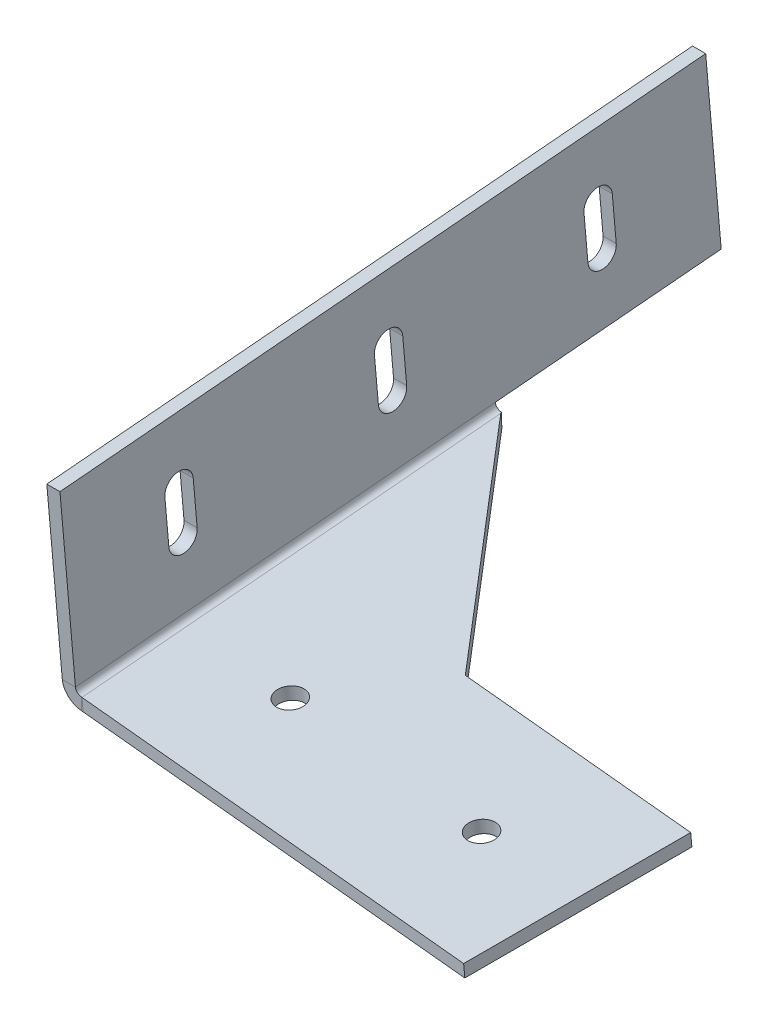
ISO-10303-21;
HEADER;
FILE_DESCRIPTION(('STEP AP214'),'2;1');
FILE_NAME('part.step','',(''),(''),'','','');
FILE_SCHEMA(('AUTOMOTIVE_DESIGN { 1 0 10303 214 1 1 1 1 }'));
ENDSEC;
DATA;
#1=APPLICATION_CONTEXT('core data for automotive mechanical design processes');
#2=APPLICATION_PROTOCOL_DEFINITION('international standard','automotive_design',2000,#1);
#3=PRODUCT_CONTEXT('',#1,'mechanical');
#4=PRODUCT('Part','Part','',(#3));
#5=PRODUCT_RELATED_PRODUCT_CATEGORY('part','',(#4));
#6=PRODUCT_DEFINITION_FORMATION('','',#4);
#7=PRODUCT_DEFINITION_CONTEXT('part definition',#1,'design');
#8=PRODUCT_DEFINITION('design','',#6,#7);
#9=PRODUCT_DEFINITION_SHAPE('','',#8);
#10=(LENGTH_UNIT() NAMED_UNIT(*) SI_UNIT(.MILLI.,.METRE.));
#11=(NAMED_UNIT(*) PLANE_ANGLE_UNIT() SI_UNIT($,.RADIAN.));
#12=(NAMED_UNIT(*) SI_UNIT($,.STERADIAN.) SOLID_ANGLE_UNIT());
#13=UNCERTAINTY_MEASURE_WITH_UNIT(LENGTH_MEASURE(1.E-05),#10,'distance_accuracy_value','');
#14=(GEOMETRIC_REPRESENTATION_CONTEXT(3) GLOBAL_UNCERTAINTY_ASSIGNED_CONTEXT((#13)) GLOBAL_UNIT_ASSIGNED_CONTEXT((#10,
#11,#12)) REPRESENTATION_CONTEXT('',''));
#15=CARTESIAN_POINT('',(0.,0.,0.));
#16=DIRECTION('',(0.,0.,1.));
#17=DIRECTION('',(1.,0.,0.));
#18=AXIS2_PLACEMENT_3D('',#15,#16,#17);
#19=CARTESIAN_POINT('',(27.028955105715,27.8532284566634,2.43684173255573));
#20=DIRECTION('',(0.,-0.996194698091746,-0.0871557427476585));
#21=DIRECTION('',(-0.0871557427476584,-0.0868240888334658,0.992403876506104));
#22=AXIS2_PLACEMENT_3D('',#19,#20,#21);
#23=PLANE('',#22);
#24=CARTESIAN_POINT('',(14.3772824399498,27.9496992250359,1.33417580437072));
#25=DIRECTION('',(0.,0.996194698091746,0.0871557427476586));
#26=DIRECTION('',(0.,-0.0871557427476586,0.996194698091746));
#27=AXIS2_PLACEMENT_3D('',#24,#25,#26);
#28=CIRCLE('',#27,1.651);
#29=CARTESIAN_POINT('',(14.3772824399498,27.8058050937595,2.97889325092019));
#30=VERTEX_POINT('',#29);
#31=EDGE_CURVE('E368',#30,#30,#28,.T.);
#32=ORIENTED_EDGE('',*,*,#31,.F.);
#33=EDGE_LOOP('',(#32));
#34=FACE_BOUND('',#33,.T.);
#35=CARTESIAN_POINT('',(39.6806277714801,27.756757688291,3.53950766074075));
#36=DIRECTION('',(0.,0.996194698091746,0.0871557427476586));
#37=DIRECTION('',(0.,-0.0871557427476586,0.996194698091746));
#38=AXIS2_PLACEMENT_3D('',#35,#36,#37);
#39=CIRCLE('',#38,1.651);
#40=CARTESIAN_POINT('',(39.6806277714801,27.6128635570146,5.18422510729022));
#41=VERTEX_POINT('',#40);
#42=EDGE_CURVE('E372',#41,#41,#39,.T.);
#43=ORIENTED_EDGE('',*,*,#42,.F.);
#44=EDGE_LOOP('',(#43));
#45=FACE_BOUND('',#44,.T.);
#46=DIRECTION('',(-0.642787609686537,0.0667651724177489,-0.763129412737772));
#47=VECTOR('',#46,1.);
#48=CARTESIAN_POINT('',(23.6204584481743,28.9903247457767,-10.5602283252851));
#49=LINE('',#48,#47);
#50=CARTESIAN_POINT('',(23.6204584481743,28.9903247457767,-10.5602283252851));
#51=VERTEX_POINT('',#50);
#52=CARTESIAN_POINT('',(0.736600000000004,31.3672292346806,-37.7283709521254));
#53=VERTEX_POINT('',#52);
#54=EDGE_CURVE('E296',#51,#53,#49,.T.);
#55=ORIENTED_EDGE('',*,*,#54,.T.);
#56=DIRECTION('',(0.,-0.0871557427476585,0.996194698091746));
#57=VECTOR('',#56,1.);
#58=CARTESIAN_POINT('',(0.7366,27.8532284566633,2.43684173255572));
#59=LINE('',#58,#57);
#60=CARTESIAN_POINT('',(0.736599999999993,26.9426053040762,12.8453119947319));
#61=VERTEX_POINT('',#60);
#62=EDGE_CURVE('E69',#53,#61,#59,.T.);
#63=ORIENTED_EDGE('',*,*,#62,.T.);
#64=DIRECTION('',(0.996194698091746,-0.00759612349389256,0.0868240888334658));
#65=VECTOR('',#64,1.);
#66=CARTESIAN_POINT('',(51.22542250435,26.5576209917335,17.2457028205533));
#67=LINE('',#66,#65);
#68=CARTESIAN_POINT('',(51.22542250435,26.5576209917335,17.2457028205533));
#69=VERTEX_POINT('',#68);
#70=EDGE_CURVE('E293',#61,#69,#67,.T.);
#71=ORIENTED_EDGE('',*,*,#70,.T.);
#72=DIRECTION('',(0.0871557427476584,0.0868240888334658,-0.992403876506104));
#73=VECTOR('',#72,1.);
#74=CARTESIAN_POINT('',(51.22542250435,26.5576209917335,17.2457028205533));
#75=LINE('',#74,#73);
#76=CARTESIAN_POINT('',(53.4391783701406,28.7629528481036,-7.96135564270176));
#77=VERTEX_POINT('',#76);
#78=EDGE_CURVE('E289',#69,#77,#75,.T.);
#79=ORIENTED_EDGE('',*,*,#78,.T.);
#80=DIRECTION('',(-0.996194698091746,0.00759612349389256,-0.0868240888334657));
#81=VECTOR('',#80,1.);
#82=CARTESIAN_POINT('',(53.4391783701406,28.7629528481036,-7.96135564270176));
#83=LINE('',#82,#81);
#84=EDGE_CURVE('E292',#77,#51,#83,.T.);
#85=ORIENTED_EDGE('',*,*,#84,.T.);
#86=EDGE_LOOP('',(#55,#63,#71,#79,#85));
#87=FACE_BOUND('',#86,.T.);
#88=ADVANCED_FACE('F58',(#34,#45,#87),#23,.F.);
#89=CARTESIAN_POINT('',(51.2254225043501,24.9761619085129,17.1073430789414));
#90=DIRECTION('',(-0.0871557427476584,-0.0868240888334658,0.992403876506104));
#91=DIRECTION('',(0.,0.996194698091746,0.0871557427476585));
#92=AXIS2_PLACEMENT_3D('',#89,#90,#91);
#93=PLANE('',#92);
#94=CARTESIAN_POINT('',(0.736599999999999,25.3611462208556,12.7069522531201));
#95=CARTESIAN_POINT('',(0.7366,26.9426053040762,12.845311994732));
#96=B_SPLINE_CURVE_WITH_KNOTS('',1,(#94,#95),.UNSPECIFIED.,.F.,.F.,(2,2),(0.,1.),.UNSPECIFIED.);
#97=CARTESIAN_POINT('',(0.736600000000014,25.3611462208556,12.70695225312));
#98=VERTEX_POINT('',#97);
#99=EDGE_CURVE('E310',#98,#61,#96,.T.);
#100=ORIENTED_EDGE('',*,*,#99,.F.);
#101=DIRECTION('',(0.996194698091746,-0.00759612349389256,0.0868240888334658));
#102=VECTOR('',#101,1.);
#103=CARTESIAN_POINT('',(51.2254225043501,24.9761619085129,17.1073430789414));
#104=LINE('',#103,#102);
#105=CARTESIAN_POINT('',(51.2254225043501,24.9761619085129,17.1073430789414));
#106=VERTEX_POINT('',#105);
#107=EDGE_CURVE('E285',#98,#106,#104,.T.);
#108=ORIENTED_EDGE('',*,*,#107,.T.);
#109=DIRECTION('',(0.,0.996194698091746,0.0871557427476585));
#110=VECTOR('',#109,1.);
#111=CARTESIAN_POINT('',(51.2254225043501,24.9761619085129,17.1073430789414));
#112=LINE('',#111,#110);
#113=EDGE_CURVE('E302',#106,#69,#112,.T.);
#114=ORIENTED_EDGE('',*,*,#113,.T.);
#115=ORIENTED_EDGE('',*,*,#70,.F.);
#116=EDGE_LOOP('',(#100,#108,#114,#115));
#117=FACE_BOUND('',#116,.T.);
#118=ADVANCED_FACE('F350',(#117),#93,.T.);
#119=CARTESIAN_POINT('',(23.6204584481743,27.4088656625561,-10.698588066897));
#120=DIRECTION('',(0.76604444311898,0.0560226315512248,-0.640341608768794));
#121=DIRECTION('',(-0.642787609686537,0.0667651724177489,-0.763129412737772));
#122=AXIS2_PLACEMENT_3D('',#119,#120,#121);
#123=PLANE('',#122);
#124=CARTESIAN_POINT('',(0.7366,31.3672292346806,-37.7283709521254));
#125=CARTESIAN_POINT('',(0.736599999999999,29.78577015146,-37.8667306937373));
#126=B_SPLINE_CURVE_WITH_KNOTS('',1,(#124,#125),.UNSPECIFIED.,.F.,.F.,(2,2),(0.,1.),.UNSPECIFIED.);
#127=CARTESIAN_POINT('',(0.736600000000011,29.78577015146,-37.8667306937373));
#128=VERTEX_POINT('',#127);
#129=EDGE_CURVE('E12',#53,#128,#126,.T.);
#130=ORIENTED_EDGE('',*,*,#129,.F.);
#131=ORIENTED_EDGE('',*,*,#54,.F.);
#132=DIRECTION('',(0.,0.996194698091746,0.0871557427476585));
#133=VECTOR('',#132,1.);
#134=CARTESIAN_POINT('',(23.6204584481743,27.4088656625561,-10.698588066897));
#135=LINE('',#134,#133);
#136=CARTESIAN_POINT('',(23.6204584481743,27.4088656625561,-10.698588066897));
#137=VERTEX_POINT('',#136);
#138=EDGE_CURVE('E297',#137,#51,#135,.T.);
#139=ORIENTED_EDGE('',*,*,#138,.F.);
#140=DIRECTION('',(-0.642787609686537,0.0667651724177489,-0.763129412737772));
#141=VECTOR('',#140,1.);
#142=CARTESIAN_POINT('',(23.6204584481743,27.4088656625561,-10.698588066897));
#143=LINE('',#142,#141);
#144=EDGE_CURVE('E288',#137,#128,#143,.T.);
#145=ORIENTED_EDGE('',*,*,#144,.T.);
#146=EDGE_LOOP('',(#130,#131,#139,#145));
#147=FACE_BOUND('',#146,.T.);
#148=ADVANCED_FACE('F60',(#147),#123,.T.);
#149=CARTESIAN_POINT('',(53.4391783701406,27.1814937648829,-8.09971538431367));
#150=DIRECTION('',(0.0871557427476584,0.0868240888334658,-0.992403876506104));
#151=DIRECTION('',(-0.996194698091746,0.00759612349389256,-0.0868240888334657));
#152=AXIS2_PLACEMENT_3D('',#149,#150,#151);
#153=PLANE('',#152);
#154=ORIENTED_EDGE('',*,*,#84,.F.);
#155=DIRECTION('',(0.,0.996194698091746,0.0871557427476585));
#156=VECTOR('',#155,1.);
#157=CARTESIAN_POINT('',(53.4391783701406,27.1814937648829,-8.09971538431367));
#158=LINE('',#157,#156);
#159=CARTESIAN_POINT('',(53.4391783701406,27.1814937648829,-8.09971538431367));
#160=VERTEX_POINT('',#159);
#161=EDGE_CURVE('E300',#160,#77,#158,.T.);
#162=ORIENTED_EDGE('',*,*,#161,.F.);
#163=DIRECTION('',(-0.996194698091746,0.00759612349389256,-0.0868240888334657));
#164=VECTOR('',#163,1.);
#165=CARTESIAN_POINT('',(53.4391783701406,27.1814937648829,-8.09971538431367));
#166=LINE('',#165,#164);
#167=EDGE_CURVE('E284',#160,#137,#166,.T.);
#168=ORIENTED_EDGE('',*,*,#167,.T.);
#169=ORIENTED_EDGE('',*,*,#138,.T.);
#170=EDGE_LOOP('',(#154,#162,#168,#169));
#171=FACE_BOUND('',#170,.T.);
#172=ADVANCED_FACE('F379',(#171),#153,.T.);
#173=CARTESIAN_POINT('',(51.2254225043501,24.9761619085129,17.1073430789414));
#174=DIRECTION('',(0.996194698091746,-0.00759612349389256,0.0868240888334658));
#175=DIRECTION('',(0.0871557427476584,0.0868240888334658,-0.992403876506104));
#176=AXIS2_PLACEMENT_3D('',#173,#174,#175);
#177=PLANE('',#176);
#178=ORIENTED_EDGE('',*,*,#78,.F.);
#179=ORIENTED_EDGE('',*,*,#113,.F.);
#180=DIRECTION('',(0.0871557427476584,0.0868240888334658,-0.992403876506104));
#181=VECTOR('',#180,1.);
#182=CARTESIAN_POINT('',(51.2254225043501,24.9761619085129,17.1073430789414));
#183=LINE('',#182,#181);
#184=EDGE_CURVE('E281',#106,#160,#183,.T.);
#185=ORIENTED_EDGE('',*,*,#184,.T.);
#186=ORIENTED_EDGE('',*,*,#161,.T.);
#187=EDGE_LOOP('',(#178,#179,#185,#186));
#188=FACE_BOUND('',#187,.T.);
#189=ADVANCED_FACE('F382',(#188),#177,.T.);
#190=CARTESIAN_POINT('',(27.028955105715,26.2717693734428,2.29848199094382));
#191=DIRECTION('',(0.,-0.996194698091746,-0.0871557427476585));
#192=DIRECTION('',(-0.0871557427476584,-0.0868240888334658,0.992403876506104));
#193=AXIS2_PLACEMENT_3D('',#190,#191,#192);
#194=PLANE('',#193);
#195=CARTESIAN_POINT('',(14.3772824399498,26.3682401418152,1.19581606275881));
#196=DIRECTION('',(0.,-0.996194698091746,-0.0871557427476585));
#197=DIRECTION('',(0.,0.0871557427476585,-0.996194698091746));
#198=AXIS2_PLACEMENT_3D('',#195,#196,#197);
#199=CIRCLE('',#198,1.651);
#200=CARTESIAN_POINT('',(14.3772824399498,26.5121342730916,-0.448901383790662));
#201=VERTEX_POINT('',#200);
#202=EDGE_CURVE('E518',#201,#201,#199,.T.);
#203=ORIENTED_EDGE('',*,*,#202,.F.);
#204=EDGE_LOOP('',(#203));
#205=FACE_BOUND('',#204,.T.);
#206=CARTESIAN_POINT('',(39.6806277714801,26.1752986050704,3.40114791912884));
#207=DIRECTION('',(0.,-0.996194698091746,-0.0871557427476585));
#208=DIRECTION('',(0.,0.0871557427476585,-0.996194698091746));
#209=AXIS2_PLACEMENT_3D('',#206,#207,#208);
#210=CIRCLE('',#209,1.651);
#211=CARTESIAN_POINT('',(39.6806277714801,26.3191927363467,1.75643047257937));
#212=VERTEX_POINT('',#211);
#213=EDGE_CURVE('E348',#212,#212,#210,.T.);
#214=ORIENTED_EDGE('',*,*,#213,.F.);
#215=EDGE_LOOP('',(#214));
#216=FACE_BOUND('',#215,.T.);
#217=DIRECTION('',(0.,-0.0871557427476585,0.996194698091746));
#218=VECTOR('',#217,1.);
#219=CARTESIAN_POINT('',(0.736600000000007,26.2717693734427,2.29848199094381));
#220=LINE('',#219,#218);
#221=EDGE_CURVE('E299',#128,#98,#220,.T.);
#222=ORIENTED_EDGE('',*,*,#221,.F.);
#223=ORIENTED_EDGE('',*,*,#144,.F.);
#224=ORIENTED_EDGE('',*,*,#167,.F.);
#225=ORIENTED_EDGE('',*,*,#184,.F.);
#226=ORIENTED_EDGE('',*,*,#107,.F.);
#227=EDGE_LOOP('',(#222,#223,#224,#225,#226));
#228=FACE_BOUND('',#227,.T.);
#229=ADVANCED_FACE('F359',(#205,#216,#228),#194,.T.);
#230=CARTESIAN_POINT('',(-1.5875,34.4996581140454,-65.080659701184));
#231=DIRECTION('',(0.,0.0871557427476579,-0.996194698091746));
#232=DIRECTION('',(0.,0.996194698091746,0.0871557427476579));
#233=AXIS2_PLACEMENT_3D('',#230,#231,#232);
#234=PLANE('',#233);
#235=DIRECTION('',(0.,0.996194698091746,0.0871557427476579));
#236=VECTOR('',#235,1.);
#237=CARTESIAN_POINT('',(0.,34.4996581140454,-65.080659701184));
#238=LINE('',#237,#236);
#239=CARTESIAN_POINT('',(0.,34.4996581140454,-65.080659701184));
#240=VERTEX_POINT('',#239);
#241=CARTESIAN_POINT('',(0.,55.8809849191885,-63.210035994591));
#242=VERTEX_POINT('',#241);
#243=EDGE_CURVE('E598',#240,#242,#238,.T.);
#244=ORIENTED_EDGE('',*,*,#243,.F.);
#245=DIRECTION('',(1.,0.,0.));
#246=VECTOR('',#245,1.);
#247=CARTESIAN_POINT('',(-1.5875,34.4996581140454,-65.080659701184));
#248=LINE('',#247,#246);
#249=CARTESIAN_POINT('',(-1.5875,34.4996581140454,-65.080659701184));
#250=VERTEX_POINT('',#249);
#251=EDGE_CURVE('E267',#250,#240,#248,.T.);
#252=ORIENTED_EDGE('',*,*,#251,.F.);
#253=DIRECTION('',(0.,0.996194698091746,0.0871557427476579));
#254=VECTOR('',#253,1.);
#255=CARTESIAN_POINT('',(-1.5875,34.4996581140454,-65.080659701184));
#256=LINE('',#255,#254);
#257=CARTESIAN_POINT('',(-1.5875,55.8809849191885,-63.210035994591));
#258=VERTEX_POINT('',#257);
#259=EDGE_CURVE('E264',#250,#258,#256,.T.);
#260=ORIENTED_EDGE('',*,*,#259,.T.);
#261=DIRECTION('',(1.,0.,0.));
#262=VECTOR('',#261,1.);
#263=CARTESIAN_POINT('',(-1.5875,55.8809849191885,-63.210035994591));
#264=LINE('',#263,#262);
#265=EDGE_CURVE('E606',#258,#242,#264,.T.);
#266=ORIENTED_EDGE('',*,*,#265,.T.);
#267=EDGE_LOOP('',(#244,#252,#260,#266));
#268=FACE_BOUND('',#267,.T.);
#269=ADVANCED_FACE('F486',(#268),#234,.T.);
#270=CARTESIAN_POINT('',(-1.5875,49.0586278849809,14.769861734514));
#271=DIRECTION('',(0.,0.996194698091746,0.0871557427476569));
#272=DIRECTION('',(0.,-0.0871557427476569,0.996194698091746));
#273=AXIS2_PLACEMENT_3D('',#270,#271,#272);
#274=PLANE('',#273);
#275=DIRECTION('',(0.,-0.0871557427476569,0.996194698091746));
#276=VECTOR('',#275,1.);
#277=CARTESIAN_POINT('',(0.,49.0586278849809,14.769861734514));
#278=LINE('',#277,#276);
#279=CARTESIAN_POINT('',(0.,49.0586278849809,14.769861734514));
#280=VERTEX_POINT('',#279);
#281=EDGE_CURVE('E615',#242,#280,#278,.T.);
#282=ORIENTED_EDGE('',*,*,#281,.F.);
#283=ORIENTED_EDGE('',*,*,#265,.F.);
#284=DIRECTION('',(0.,-0.0871557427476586,0.996194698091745));
#285=VECTOR('',#284,1.);
#286=CARTESIAN_POINT('',(-1.5875,55.8809849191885,-63.210035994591));
#287=LINE('',#286,#285);
#288=CARTESIAN_POINT('',(-1.5875,49.0586278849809,14.769861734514));
#289=VERTEX_POINT('',#288);
#290=EDGE_CURVE('E604',#258,#289,#287,.T.);
#291=ORIENTED_EDGE('',*,*,#290,.T.);
#292=DIRECTION('',(1.,0.,0.));
#293=VECTOR('',#292,1.);
#294=CARTESIAN_POINT('',(-1.5875,49.0586278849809,14.769861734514));
#295=LINE('',#294,#293);
#296=EDGE_CURVE('E248',#289,#280,#295,.T.);
#297=ORIENTED_EDGE('',*,*,#296,.T.);
#298=EDGE_LOOP('',(#282,#283,#291,#297));
#299=FACE_BOUND('',#298,.T.);
#300=ADVANCED_FACE('F489',(#299),#274,.T.);
#301=CARTESIAN_POINT('',(-1.5875,0.,0.));
#302=DIRECTION('',(-1.,0.,0.));
#303=DIRECTION('',(0.,0.,1.));
#304=AXIS2_PLACEMENT_3D('',#301,#302,#303);
#305=PLANE('',#304);
#306=CARTESIAN_POINT('',(-1.5875,42.2854967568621,0.385925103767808));
#307=DIRECTION('',(1.,0.,0.));
#308=DIRECTION('',(0.,0.,-1.));
#309=AXIS2_PLACEMENT_3D('',#306,#307,#308);
#310=CIRCLE('',#309,1.7145);
#311=CARTESIAN_POINT('',(-1.5875,42.434925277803,-1.32205070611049));
#312=VERTEX_POINT('',#311);
#313=CARTESIAN_POINT('',(-1.5875,42.1360682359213,2.0939009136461));
#314=VERTEX_POINT('',#313);
#315=EDGE_CURVE('E63',#312,#314,#310,.T.);
#316=ORIENTED_EDGE('',*,*,#315,.T.);
#317=DIRECTION('',(0.,0.996194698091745,0.0871557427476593));
#318=VECTOR('',#317,1.);
#319=CARTESIAN_POINT('',(-1.5875,36.6958489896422,1.61794340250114));
#320=LINE('',#319,#318);
#321=CARTESIAN_POINT('',(-1.5875,36.6958489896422,1.61794340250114));
#322=VERTEX_POINT('',#321);
#323=EDGE_CURVE('E936',#314,#322,#320,.F.);
#324=ORIENTED_EDGE('',*,*,#323,.T.);
#325=CARTESIAN_POINT('',(-1.5875,36.8452775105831,-0.0900324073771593));
#326=DIRECTION('',(1.,0.,0.));
#327=DIRECTION('',(0.,0.,-1.));
#328=AXIS2_PLACEMENT_3D('',#325,#326,#327);
#329=CIRCLE('',#328,1.7145);
#330=CARTESIAN_POINT('',(-1.5875,36.994706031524,-1.79800821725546));
#331=VERTEX_POINT('',#330);
#332=EDGE_CURVE('E77',#322,#331,#329,.T.);
#333=ORIENTED_EDGE('',*,*,#332,.T.);
#334=DIRECTION('',(0.,-0.996194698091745,-0.0871557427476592));
#335=VECTOR('',#334,1.);
#336=CARTESIAN_POINT('',(-1.5875,42.434925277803,-1.32205070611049));
#337=LINE('',#336,#335);
#338=EDGE_CURVE('E945',#331,#312,#337,.F.);
#339=ORIENTED_EDGE('',*,*,#338,.T.);
#340=EDGE_LOOP('',(#316,#324,#333,#339));
#341=FACE_BOUND('',#340,.T.);
#342=CARTESIAN_POINT('',(-1.5875,44.4992526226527,-24.9174202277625));
#343=DIRECTION('',(1.,0.,0.));
#344=DIRECTION('',(0.,0.,-1.));
#345=AXIS2_PLACEMENT_3D('',#342,#343,#344);
#346=CIRCLE('',#345,1.71450000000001);
#347=CARTESIAN_POINT('',(-1.5875,44.6486811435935,-26.6253960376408));
#348=VERTEX_POINT('',#347);
#349=CARTESIAN_POINT('',(-1.5875,44.3498241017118,-23.2094444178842));
#350=VERTEX_POINT('',#349);
#351=EDGE_CURVE('E941',#348,#350,#346,.T.);
#352=ORIENTED_EDGE('',*,*,#351,.T.);
#353=DIRECTION('',(0.,0.996194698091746,0.0871557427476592));
#354=VECTOR('',#353,1.);
#355=CARTESIAN_POINT('',(-1.5875,38.9096048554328,-23.6854019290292));
#356=LINE('',#355,#354);
#357=CARTESIAN_POINT('',(-1.5875,38.9096048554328,-23.6854019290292));
#358=VERTEX_POINT('',#357);
#359=EDGE_CURVE('E956',#350,#358,#356,.F.);
#360=ORIENTED_EDGE('',*,*,#359,.T.);
#361=CARTESIAN_POINT('',(-1.5875,39.0590333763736,-25.3933777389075));
#362=DIRECTION('',(1.,0.,0.));
#363=DIRECTION('',(0.,0.,-1.));
#364=AXIS2_PLACEMENT_3D('',#361,#362,#363);
#365=CIRCLE('',#364,1.71450000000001);
#366=CARTESIAN_POINT('',(-1.5875,39.2084618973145,-27.1013535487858));
#367=VERTEX_POINT('',#366);
#368=EDGE_CURVE('E953',#358,#367,#365,.T.);
#369=ORIENTED_EDGE('',*,*,#368,.T.);
#370=DIRECTION('',(0.,-0.996194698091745,-0.0871557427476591));
#371=VECTOR('',#370,1.);
#372=CARTESIAN_POINT('',(-1.5875,44.6486811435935,-26.6253960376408));
#373=LINE('',#372,#371);
#374=EDGE_CURVE('E950',#367,#348,#373,.F.);
#375=ORIENTED_EDGE('',*,*,#374,.T.);
#376=EDGE_LOOP('',(#352,#360,#369,#375));
#377=FACE_BOUND('',#376,.T.);
#378=CARTESIAN_POINT('',(-1.5875,46.7130084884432,-50.2207655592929));
#379=DIRECTION('',(1.,0.,0.));
#380=DIRECTION('',(0.,0.,-1.));
#381=AXIS2_PLACEMENT_3D('',#378,#379,#380);
#382=CIRCLE('',#381,1.7145);
#383=CARTESIAN_POINT('',(-1.5875,46.862437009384,-51.9287413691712));
#384=VERTEX_POINT('',#383);
#385=CARTESIAN_POINT('',(-1.5875,46.5635799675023,-48.5127897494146));
#386=VERTEX_POINT('',#385);
#387=EDGE_CURVE('E959',#384,#386,#382,.T.);
#388=ORIENTED_EDGE('',*,*,#387,.T.);
#389=DIRECTION('',(0.,0.996194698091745,0.0871557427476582));
#390=VECTOR('',#389,1.);
#391=CARTESIAN_POINT('',(-1.5875,41.1233607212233,-48.9887472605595));
#392=LINE('',#391,#390);
#393=CARTESIAN_POINT('',(-1.5875,41.1233607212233,-48.9887472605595));
#394=VERTEX_POINT('',#393);
#395=EDGE_CURVE('E968',#386,#394,#392,.F.);
#396=ORIENTED_EDGE('',*,*,#395,.T.);
#397=CARTESIAN_POINT('',(-1.5875,41.2727892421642,-50.6967230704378));
#398=DIRECTION('',(1.,0.,0.));
#399=DIRECTION('',(0.,0.,-1.));
#400=AXIS2_PLACEMENT_3D('',#397,#398,#399);
#401=CIRCLE('',#400,1.7145);
#402=CARTESIAN_POINT('',(-1.5875,41.422217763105,-52.4046988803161));
#403=VERTEX_POINT('',#402);
#404=EDGE_CURVE('E965',#394,#403,#401,.T.);
#405=ORIENTED_EDGE('',*,*,#404,.T.);
#406=DIRECTION('',(0.,-0.996194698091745,-0.0871557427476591));
#407=VECTOR('',#406,1.);
#408=CARTESIAN_POINT('',(-1.5875,46.8624370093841,-51.9287413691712));
#409=LINE('',#408,#407);
#410=EDGE_CURVE('E962',#403,#384,#409,.F.);
#411=ORIENTED_EDGE('',*,*,#410,.T.);
#412=EDGE_LOOP('',(#388,#396,#405,#411));
#413=FACE_BOUND('',#412,.T.);
#414=DIRECTION('',(0.,0.0871557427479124,-0.996194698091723));
#415=VECTOR('',#414,1.);
#416=CARTESIAN_POINT('',(-1.5875,32.1132689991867,-37.8041073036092));
#417=LINE('',#416,#415);
#418=CARTESIAN_POINT('',(-1.5875,32.1132689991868,-37.8041073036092));
#419=VERTEX_POINT('',#418);
#420=EDGE_CURVE('E260',#419,#250,#417,.T.);
#421=ORIENTED_EDGE('',*,*,#420,.F.);
#422=DIRECTION('',(0.,-0.0871557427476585,0.996194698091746));
#423=VECTOR('',#422,1.);
#424=CARTESIAN_POINT('',(-1.5875,28.5870254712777,2.50104065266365));
#425=LINE('',#424,#423);
#426=CARTESIAN_POINT('',(-1.5875,27.6773010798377,12.8992380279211));
#427=VERTEX_POINT('',#426);
#428=EDGE_CURVE('E235',#419,#427,#425,.T.);
#429=ORIENTED_EDGE('',*,*,#428,.T.);
#430=DIRECTION('',(0.,-0.996194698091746,-0.0871557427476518));
#431=VECTOR('',#430,1.);
#432=CARTESIAN_POINT('',(-1.5875,25.4,12.7));
#433=LINE('',#432,#431);
#434=EDGE_CURVE('E247',#289,#427,#433,.T.);
#435=ORIENTED_EDGE('',*,*,#434,.F.);
#436=ORIENTED_EDGE('',*,*,#290,.F.);
#437=ORIENTED_EDGE('',*,*,#259,.F.);
#438=EDGE_LOOP('',(#421,#429,#435,#436,#437));
#439=FACE_BOUND('',#438,.T.);
#440=ADVANCED_FACE('F261',(#341,#377,#413,#439),#305,.T.);
#441=CARTESIAN_POINT('',(-1.5875,25.4,12.7));
#442=DIRECTION('',(0.,-0.0871557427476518,0.996194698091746));
#443=DIRECTION('',(0.,-0.996194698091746,-0.0871557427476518));
#444=AXIS2_PLACEMENT_3D('',#441,#442,#443);
#445=PLANE('',#444);
#446=ORIENTED_EDGE('',*,*,#434,.T.);
#447=DIRECTION('',(1.,0.,0.));
#448=VECTOR('',#447,1.);
#449=CARTESIAN_POINT('',(-1.5875,27.6773010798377,12.8992380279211));
#450=LINE('',#449,#448);
#451=CARTESIAN_POINT('',(0.,27.6773010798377,12.8992380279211));
#452=VERTEX_POINT('',#451);
#453=EDGE_CURVE('E595',#427,#452,#450,.T.);
#454=ORIENTED_EDGE('',*,*,#453,.T.);
#455=DIRECTION('',(0.,-0.996194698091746,-0.0871557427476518));
#456=VECTOR('',#455,1.);
#457=CARTESIAN_POINT('',(0.,25.4,12.7));
#458=LINE('',#457,#456);
#459=EDGE_CURVE('E268',#280,#452,#458,.T.);
#460=ORIENTED_EDGE('',*,*,#459,.F.);
#461=ORIENTED_EDGE('',*,*,#296,.F.);
#462=EDGE_LOOP('',(#446,#454,#460,#461));
#463=FACE_BOUND('',#462,.T.);
#464=ADVANCED_FACE('F496',(#463),#445,.T.);
#465=CARTESIAN_POINT('',(0.,0.,0.));
#466=DIRECTION('',(-1.,0.,0.));
#467=DIRECTION('',(0.,0.,1.));
#468=AXIS2_PLACEMENT_3D('',#465,#466,#467);
#469=PLANE('',#468);
#470=DIRECTION('',(0.,-0.996194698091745,-0.0871557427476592));
#471=VECTOR('',#470,1.);
#472=CARTESIAN_POINT('',(0.,42.1360682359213,2.0939009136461));
#473=LINE('',#472,#471);
#474=CARTESIAN_POINT('',(0.,42.1360682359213,2.0939009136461));
#475=VERTEX_POINT('',#474);
#476=CARTESIAN_POINT('',(0.,36.6958489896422,1.61794340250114));
#477=VERTEX_POINT('',#476);
#478=EDGE_CURVE('E1019',#475,#477,#473,.T.);
#479=ORIENTED_EDGE('',*,*,#478,.F.);
#480=CARTESIAN_POINT('',(0.,42.2854967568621,0.385925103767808));
#481=DIRECTION('',(1.,0.,0.));
#482=DIRECTION('',(0.,0.,-1.));
#483=AXIS2_PLACEMENT_3D('',#480,#481,#482);
#484=CIRCLE('',#483,1.7145);
#485=CARTESIAN_POINT('',(0.,42.434925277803,-1.32205070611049));
#486=VERTEX_POINT('',#485);
#487=EDGE_CURVE('E978',#486,#475,#484,.T.);
#488=ORIENTED_EDGE('',*,*,#487,.F.);
#489=DIRECTION('',(0.,0.996194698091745,0.0871557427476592));
#490=VECTOR('',#489,1.);
#491=CARTESIAN_POINT('',(0.,42.434925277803,-1.32205070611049));
#492=LINE('',#491,#490);
#493=CARTESIAN_POINT('',(0.,36.994706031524,-1.79800821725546));
#494=VERTEX_POINT('',#493);
#495=EDGE_CURVE('E976',#494,#486,#492,.T.);
#496=ORIENTED_EDGE('',*,*,#495,.F.);
#497=CARTESIAN_POINT('',(0.,36.8452775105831,-0.0900324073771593));
#498=DIRECTION('',(1.,0.,0.));
#499=DIRECTION('',(0.,0.,-1.));
#500=AXIS2_PLACEMENT_3D('',#497,#498,#499);
#501=CIRCLE('',#500,1.7145);
#502=EDGE_CURVE('E1017',#477,#494,#501,.T.);
#503=ORIENTED_EDGE('',*,*,#502,.F.);
#504=EDGE_LOOP('',(#479,#488,#496,#503));
#505=FACE_BOUND('',#504,.T.);
#506=DIRECTION('',(0.,-0.996194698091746,-0.0871557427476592));
#507=VECTOR('',#506,1.);
#508=CARTESIAN_POINT('',(0.,44.3498241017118,-23.2094444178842));
#509=LINE('',#508,#507);
#510=CARTESIAN_POINT('',(0.,44.3498241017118,-23.2094444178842));
#511=VERTEX_POINT('',#510);
#512=CARTESIAN_POINT('',(0.,38.9096048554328,-23.6854019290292));
#513=VERTEX_POINT('',#512);
#514=EDGE_CURVE('E1012',#511,#513,#509,.T.);
#515=ORIENTED_EDGE('',*,*,#514,.F.);
#516=CARTESIAN_POINT('',(0.,44.4992526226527,-24.9174202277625));
#517=DIRECTION('',(1.,0.,0.));
#518=DIRECTION('',(0.,0.,-1.));
#519=AXIS2_PLACEMENT_3D('',#516,#517,#518);
#520=CIRCLE('',#519,1.71450000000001);
#521=CARTESIAN_POINT('',(0.,44.6486811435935,-26.6253960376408));
#522=VERTEX_POINT('',#521);
#523=EDGE_CURVE('E989',#522,#511,#520,.T.);
#524=ORIENTED_EDGE('',*,*,#523,.F.);
#525=DIRECTION('',(0.,0.996194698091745,0.0871557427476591));
#526=VECTOR('',#525,1.);
#527=CARTESIAN_POINT('',(0.,44.6486811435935,-26.6253960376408));
#528=LINE('',#527,#526);
#529=CARTESIAN_POINT('',(0.,39.2084618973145,-27.1013535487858));
#530=VERTEX_POINT('',#529);
#531=EDGE_CURVE('E986',#530,#522,#528,.T.);
#532=ORIENTED_EDGE('',*,*,#531,.F.);
#533=CARTESIAN_POINT('',(0.,39.0590333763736,-25.3933777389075));
#534=DIRECTION('',(1.,0.,0.));
#535=DIRECTION('',(0.,0.,-1.));
#536=AXIS2_PLACEMENT_3D('',#533,#534,#535);
#537=CIRCLE('',#536,1.71450000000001);
#538=EDGE_CURVE('E1009',#513,#530,#537,.T.);
#539=ORIENTED_EDGE('',*,*,#538,.F.);
#540=EDGE_LOOP('',(#515,#524,#532,#539));
#541=FACE_BOUND('',#540,.T.);
#542=DIRECTION('',(0.,-0.996194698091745,-0.087155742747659));
#543=VECTOR('',#542,1.);
#544=CARTESIAN_POINT('',(0.,46.5635799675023,-48.5127897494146));
#545=LINE('',#544,#543);
#546=CARTESIAN_POINT('',(0.,46.5635799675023,-48.5127897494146));
#547=VERTEX_POINT('',#546);
#548=CARTESIAN_POINT('',(0.,41.1233607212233,-48.9887472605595));
#549=VERTEX_POINT('',#548);
#550=EDGE_CURVE('E1003',#547,#549,#545,.T.);
#551=ORIENTED_EDGE('',*,*,#550,.F.);
#552=CARTESIAN_POINT('',(0.,46.7130084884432,-50.2207655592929));
#553=DIRECTION('',(1.,0.,0.));
#554=DIRECTION('',(0.,0.,-1.));
#555=AXIS2_PLACEMENT_3D('',#552,#553,#554);
#556=CIRCLE('',#555,1.7145);
#557=CARTESIAN_POINT('',(0.,46.862437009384,-51.9287413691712));
#558=VERTEX_POINT('',#557);
#559=EDGE_CURVE('E1006',#558,#547,#556,.T.);
#560=ORIENTED_EDGE('',*,*,#559,.F.);
#561=DIRECTION('',(0.,0.996194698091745,0.0871557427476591));
#562=VECTOR('',#561,1.);
#563=CARTESIAN_POINT('',(0.,46.862437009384,-51.9287413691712));
#564=LINE('',#563,#562);
#565=CARTESIAN_POINT('',(0.,41.422217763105,-52.4046988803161));
#566=VERTEX_POINT('',#565);
#567=EDGE_CURVE('E997',#566,#558,#564,.T.);
#568=ORIENTED_EDGE('',*,*,#567,.F.);
#569=CARTESIAN_POINT('',(0.,41.2727892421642,-50.6967230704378));
#570=DIRECTION('',(1.,0.,0.));
#571=DIRECTION('',(0.,0.,-1.));
#572=AXIS2_PLACEMENT_3D('',#569,#570,#571);
#573=CIRCLE('',#572,1.7145);
#574=EDGE_CURVE('E1000',#549,#566,#573,.T.);
#575=ORIENTED_EDGE('',*,*,#574,.F.);
#576=EDGE_LOOP('',(#551,#560,#568,#575));
#577=FACE_BOUND('',#576,.T.);
#578=DIRECTION('',(0.,-0.0871557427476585,0.996194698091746));
#579=VECTOR('',#578,1.);
#580=CARTESIAN_POINT('',(0.,28.5870254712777,2.50104065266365));
#581=LINE('',#580,#579);
#582=CARTESIAN_POINT('',(0.,32.1132689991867,-37.8041073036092));
#583=VERTEX_POINT('',#582);
#584=EDGE_CURVE('E275',#583,#452,#581,.T.);
#585=ORIENTED_EDGE('',*,*,#584,.F.);
#586=DIRECTION('',(0.,0.0871557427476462,-0.996194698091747));
#587=VECTOR('',#586,1.);
#588=CARTESIAN_POINT('',(0.,32.2239567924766,-39.0692745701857));
#589=LINE('',#588,#587);
#590=EDGE_CURVE('E273',#583,#240,#589,.T.);
#591=ORIENTED_EDGE('',*,*,#590,.T.);
#592=ORIENTED_EDGE('',*,*,#243,.T.);
#593=ORIENTED_EDGE('',*,*,#281,.T.);
#594=ORIENTED_EDGE('',*,*,#459,.T.);
#595=EDGE_LOOP('',(#585,#591,#592,#593,#594));
#596=FACE_BOUND('',#595,.T.);
#597=ADVANCED_FACE('F500',(#505,#541,#577,#596),#469,.F.);
#598=CARTESIAN_POINT('',(-1.5875,32.2239567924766,-39.0692745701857));
#599=DIRECTION('',(0.,-0.996194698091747,-0.0871557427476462));
#600=DIRECTION('',(0.,0.0871557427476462,-0.996194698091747));
#601=AXIS2_PLACEMENT_3D('',#598,#599,#600);
#602=PLANE('',#601);
#603=ORIENTED_EDGE('',*,*,#590,.F.);
#604=DIRECTION('',(1.,0.,0.));
#605=VECTOR('',#604,1.);
#606=CARTESIAN_POINT('',(-1.5875,32.1132689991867,-37.8041073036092));
#607=LINE('',#606,#605);
#608=EDGE_CURVE('E254',#419,#583,#607,.T.);
#609=ORIENTED_EDGE('',*,*,#608,.F.);
#610=ORIENTED_EDGE('',*,*,#420,.T.);
#611=ORIENTED_EDGE('',*,*,#251,.T.);
#612=EDGE_LOOP('',(#603,#609,#610,#611));
#613=FACE_BOUND('',#612,.T.);
#614=ADVANCED_FACE('F271',(#613),#602,.T.);
#615=CARTESIAN_POINT('',(0.557773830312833,29.8048767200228,-38.0060654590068));
#616=CARTESIAN_POINT('',(0.617264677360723,29.7962221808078,-37.9598204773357));
#617=CARTESIAN_POINT('',(0.676932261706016,29.7898510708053,-37.9133758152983));
#618=CARTESIAN_POINT('',(0.736599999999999,29.78577015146,-37.8667306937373));
#619=CARTESIAN_POINT('',(0.679922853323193,31.3816474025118,-37.868115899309));
#620=CARTESIAN_POINT('',(0.69877786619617,31.3761169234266,-37.8215976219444));
#621=CARTESIAN_POINT('',(0.717688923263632,31.371310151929,-37.7750160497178));
#622=CARTESIAN_POINT('',(0.7366,31.3672292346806,-37.7283709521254));
#623=B_SPLINE_SURFACE_WITH_KNOTS('',1,3,((#615,#616,#617,#618),(#619,#620,#621,#622)),
.UNSPECIFIED.,.F.,.F.,.F.,(2,2),(4,4),(0.,1.),(0.,1.),.UNSPECIFIED.);
#624=CARTESIAN_POINT('',(0.557773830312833,29.8048767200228,-38.0060654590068));
#625=CARTESIAN_POINT('',(0.679922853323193,31.3816474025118,-37.868115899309));
#626=B_SPLINE_CURVE_WITH_KNOTS('',1,(#624,#625),.UNSPECIFIED.,.F.,.F.,(2,2),(0.,1.),.UNSPECIFIED.);
#627=CARTESIAN_POINT('',(0.679922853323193,31.3816474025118,-37.868115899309));
#628=VERTEX_POINT('',#627);
#629=CARTESIAN_POINT('',(0.557773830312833,29.8048767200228,-38.0060654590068));
#630=VERTEX_POINT('',#629);
#631=EDGE_CURVE('E103',#628,#630,#626,.F.);
#632=CARTESIAN_POINT('',(0.679922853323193,31.3816474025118,-37.868115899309));
#633=CARTESIAN_POINT('',(0.69877786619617,31.3761169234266,-37.8215976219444));
#634=CARTESIAN_POINT('',(0.717688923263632,31.371310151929,-37.7750160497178));
#635=CARTESIAN_POINT('',(0.7366,31.3672292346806,-37.7283709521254));
#636=B_SPLINE_CURVE_WITH_KNOTS('',3,(#632,#633,#634,#635),.UNSPECIFIED.,.F.,.F.,(4,4),(0.,1.),.UNSPECIFIED.);
#637=EDGE_CURVE('E522',#628,#53,#636,.T.);
#638=CARTESIAN_POINT('',(0.736599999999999,29.78577015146,-37.8667306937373));
#639=CARTESIAN_POINT('',(0.676932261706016,29.7898510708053,-37.9133758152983));
#640=CARTESIAN_POINT('',(0.617264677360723,29.7962221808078,-37.9598204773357));
#641=CARTESIAN_POINT('',(0.557773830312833,29.8048767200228,-38.0060654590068));
#642=B_SPLINE_CURVE_WITH_KNOTS('',3,(#638,#639,#640,#641),.UNSPECIFIED.,.F.,.F.,(4,4),(0.,1.),.UNSPECIFIED.);
#643=EDGE_CURVE('E387',#630,#128,#642,.F.);
#644=ORIENTED_EDGE('',*,*,#631,.F.);
#645=ORIENTED_EDGE('',*,*,#637,.T.);
#646=ORIENTED_EDGE('',*,*,#129,.T.);
#647=ORIENTED_EDGE('',*,*,#643,.F.);
#648=EDGE_LOOP('',(#644,#645,#646,#647));
#649=FACE_BOUND('',#648,.T.);
#650=ADVANCED_FACE('F420',(#649),#623,.T.);
#651=CARTESIAN_POINT('',(0.736599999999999,25.3611462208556,12.7069522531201));
#652=CARTESIAN_POINT('',(0.676932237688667,25.3614458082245,12.7035279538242));
#653=CARTESIAN_POINT('',(0.617264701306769,25.3640355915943,12.7003040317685));
#654=CARTESIAN_POINT('',(0.557773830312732,25.3689088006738,12.6972798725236));
#655=CARTESIAN_POINT('',(0.7366,26.9426053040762,12.845311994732));
#656=CARTESIAN_POINT('',(0.717688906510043,26.942904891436,12.8418876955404));
#657=CARTESIAN_POINT('',(0.698777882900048,26.943930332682,12.8385269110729));
#658=CARTESIAN_POINT('',(0.679922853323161,26.9456794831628,12.8352294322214));
#659=B_SPLINE_SURFACE_WITH_KNOTS('',1,3,((#651,#652,#653,#654),(#655,#656,#657,#658)),
.UNSPECIFIED.,.F.,.F.,.F.,(2,2),(4,4),(0.,1.),(0.,1.),.UNSPECIFIED.);
#660=CARTESIAN_POINT('',(0.7366,26.9426053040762,12.845311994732));
#661=CARTESIAN_POINT('',(0.717688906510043,26.942904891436,12.8418876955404));
#662=CARTESIAN_POINT('',(0.698777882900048,26.943930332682,12.8385269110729));
#663=CARTESIAN_POINT('',(0.679922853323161,26.9456794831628,12.8352294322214));
#664=B_SPLINE_CURVE_WITH_KNOTS('',3,(#660,#661,#662,#663),.UNSPECIFIED.,.F.,.F.,(4,4),(0.,1.),.UNSPECIFIED.);
#665=CARTESIAN_POINT('',(0.679922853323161,26.9456794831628,12.8352294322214));
#666=VERTEX_POINT('',#665);
#667=EDGE_CURVE('E532',#61,#666,#664,.T.);
#668=CARTESIAN_POINT('',(0.679922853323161,26.9456794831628,12.8352294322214));
#669=CARTESIAN_POINT('',(0.557773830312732,25.3689088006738,12.6972798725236));
#670=B_SPLINE_CURVE_WITH_KNOTS('',1,(#668,#669),.UNSPECIFIED.,.F.,.F.,(2,2),(0.,1.),.UNSPECIFIED.);
#671=CARTESIAN_POINT('',(0.557773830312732,25.3689088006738,12.6972798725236));
#672=VERTEX_POINT('',#671);
#673=EDGE_CURVE('E257',#666,#672,#670,.T.);
#674=CARTESIAN_POINT('',(0.557773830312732,25.3689088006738,12.6972798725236));
#675=CARTESIAN_POINT('',(0.617264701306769,25.3640355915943,12.7003040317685));
#676=CARTESIAN_POINT('',(0.676932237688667,25.3614458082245,12.7035279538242));
#677=CARTESIAN_POINT('',(0.736599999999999,25.3611462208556,12.7069522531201));
#678=B_SPLINE_CURVE_WITH_KNOTS('',3,(#674,#675,#676,#677),.UNSPECIFIED.,.F.,.F.,(4,4),(0.,1.),.UNSPECIFIED.);
#679=EDGE_CURVE('E385',#98,#672,#678,.F.);
#680=ORIENTED_EDGE('',*,*,#99,.T.);
#681=ORIENTED_EDGE('',*,*,#667,.T.);
#682=ORIENTED_EDGE('',*,*,#673,.T.);
#683=ORIENTED_EDGE('',*,*,#679,.F.);
#684=EDGE_LOOP('',(#680,#681,#682,#683));
#685=FACE_BOUND('',#684,.T.);
#686=ADVANCED_FACE('F391',(#685),#659,.T.);
#687=CARTESIAN_POINT('',(0.7366,27.6773010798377,12.8992380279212));
#688=DIRECTION('',(0.,-0.0871557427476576,0.996194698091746));
#689=DIRECTION('',(0.,-0.996194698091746,-0.0871557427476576));
#690=AXIS2_PLACEMENT_3D('',#687,#688,#689);
#691=PLANE('',#690);
#692=ORIENTED_EDGE('',*,*,#673,.F.);
#693=CARTESIAN_POINT('',(0.7366,27.6773010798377,12.8992380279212));
#694=DIRECTION('',(0.,-0.0871557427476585,0.996194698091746));
#695=DIRECTION('',(0.,-0.996194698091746,-0.0871557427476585));
#696=AXIS2_PLACEMENT_3D('',#693,#694,#695);
#697=CIRCLE('',#696,0.7366);
#698=EDGE_CURVE('E529',#666,#452,#697,.F.);
#699=ORIENTED_EDGE('',*,*,#698,.T.);
#700=ORIENTED_EDGE('',*,*,#453,.F.);
#701=CARTESIAN_POINT('',(0.7366,27.6773010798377,12.8992380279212));
#702=DIRECTION('',(0.,0.0871557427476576,-0.996194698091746));
#703=DIRECTION('',(0.,-0.996194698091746,-0.0871557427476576));
#704=AXIS2_PLACEMENT_3D('',#701,#702,#703);
#705=CIRCLE('',#704,2.3241);
#706=EDGE_CURVE('E242',#672,#427,#705,.T.);
#707=ORIENTED_EDGE('',*,*,#706,.F.);
#708=EDGE_LOOP('',(#692,#699,#700,#707));
#709=FACE_BOUND('',#708,.T.);
#710=ADVANCED_FACE('F419',(#709),#691,.T.);
#711=CARTESIAN_POINT('',(0.7366,32.1132689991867,-37.8041073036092));
#712=DIRECTION('',(0.,0.0871557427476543,-0.996194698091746));
#713=DIRECTION('',(0.,0.996194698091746,0.0871557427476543));
#714=AXIS2_PLACEMENT_3D('',#711,#712,#713);
#715=PLANE('',#714);
#716=CARTESIAN_POINT('',(0.7366,32.1132689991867,-37.8041073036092));
#717=DIRECTION('',(0.,-0.0871557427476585,0.996194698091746));
#718=DIRECTION('',(0.,-0.996194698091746,-0.0871557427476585));
#719=AXIS2_PLACEMENT_3D('',#716,#717,#718);
#720=CIRCLE('',#719,0.7366);
#721=EDGE_CURVE('E531',#583,#628,#720,.T.);
#722=ORIENTED_EDGE('',*,*,#721,.T.);
#723=ORIENTED_EDGE('',*,*,#631,.T.);
#724=CARTESIAN_POINT('',(0.7366,32.1132689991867,-37.8041073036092));
#725=DIRECTION('',(0.,-0.0871557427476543,0.996194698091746));
#726=DIRECTION('',(0.,0.996194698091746,0.0871557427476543));
#727=AXIS2_PLACEMENT_3D('',#724,#725,#726);
#728=CIRCLE('',#727,2.3241);
#729=EDGE_CURVE('E239',#419,#630,#728,.T.);
#730=ORIENTED_EDGE('',*,*,#729,.F.);
#731=ORIENTED_EDGE('',*,*,#608,.T.);
#732=EDGE_LOOP('',(#722,#723,#730,#731));
#733=FACE_BOUND('',#732,.T.);
#734=ADVANCED_FACE('F252',(#733),#715,.T.);
#735=CARTESIAN_POINT('',(0.7366,34.3736518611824,-63.6404016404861));
#736=DIRECTION('',(0.,-0.0871557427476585,0.996194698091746));
#737=DIRECTION('',(0.,-0.996194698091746,-0.0871557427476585));
#738=AXIS2_PLACEMENT_3D('',#735,#736,#737);
#739=CYLINDRICAL_SURFACE('',#738,2.3241);
#740=ORIENTED_EDGE('',*,*,#428,.F.);
#741=ORIENTED_EDGE('',*,*,#729,.T.);
#742=ORIENTED_EDGE('',*,*,#643,.T.);
#743=ORIENTED_EDGE('',*,*,#221,.T.);
#744=ORIENTED_EDGE('',*,*,#679,.T.);
#745=ORIENTED_EDGE('',*,*,#706,.T.);
#746=EDGE_LOOP('',(#740,#741,#742,#743,#744,#745));
#747=FACE_BOUND('',#746,.T.);
#748=ADVANCED_FACE('F237',(#747),#739,.T.);
#749=CARTESIAN_POINT('',(0.7366,34.3736518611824,-63.6404016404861));
#750=DIRECTION('',(0.,-0.0871557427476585,0.996194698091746));
#751=DIRECTION('',(0.,-0.996194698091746,-0.0871557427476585));
#752=AXIS2_PLACEMENT_3D('',#749,#750,#751);
#753=CYLINDRICAL_SURFACE('',#752,0.7366);
#754=ORIENTED_EDGE('',*,*,#584,.T.);
#755=ORIENTED_EDGE('',*,*,#698,.F.);
#756=ORIENTED_EDGE('',*,*,#667,.F.);
#757=ORIENTED_EDGE('',*,*,#62,.F.);
#758=ORIENTED_EDGE('',*,*,#637,.F.);
#759=ORIENTED_EDGE('',*,*,#721,.F.);
#760=EDGE_LOOP('',(#754,#755,#756,#757,#758,#759));
#761=FACE_BOUND('',#760,.T.);
#762=ADVANCED_FACE('F548',(#761),#753,.F.);
#763=CARTESIAN_POINT('',(39.6806277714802,19.0393753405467,2.77683552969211));
#764=DIRECTION('',(0.,0.996194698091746,0.0871557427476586));
#765=DIRECTION('',(0.,-0.0871557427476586,0.996194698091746));
#766=AXIS2_PLACEMENT_3D('',#763,#764,#765);
#767=CYLINDRICAL_SURFACE('',#766,1.651);
#768=ORIENTED_EDGE('',*,*,#213,.T.);
#769=EDGE_LOOP('',(#768));
#770=FACE_BOUND('',#769,.T.);
#771=ORIENTED_EDGE('',*,*,#42,.T.);
#772=EDGE_LOOP('',(#771));
#773=FACE_BOUND('',#772,.T.);
#774=ADVANCED_FACE('F549',(#770,#773),#767,.F.);
#775=CARTESIAN_POINT('',(14.3772824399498,19.2323168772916,0.571503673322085));
#776=DIRECTION('',(0.,0.996194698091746,0.0871557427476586));
#777=DIRECTION('',(0.,-0.0871557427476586,0.996194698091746));
#778=AXIS2_PLACEMENT_3D('',#775,#776,#777);
#779=CYLINDRICAL_SURFACE('',#778,1.651);
#780=ORIENTED_EDGE('',*,*,#202,.T.);
#781=EDGE_LOOP('',(#780));
#782=FACE_BOUND('',#781,.T.);
#783=ORIENTED_EDGE('',*,*,#31,.T.);
#784=EDGE_LOOP('',(#783));
#785=FACE_BOUND('',#784,.T.);
#786=ADVANCED_FACE('F649',(#782,#785),#779,.F.);
#787=CARTESIAN_POINT('',(-1.587525,46.7130084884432,-50.2207655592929));
#788=DIRECTION('',(1.,0.,0.));
#789=DIRECTION('',(0.,0.,-1.));
#790=AXIS2_PLACEMENT_3D('',#787,#788,#789);
#791=CYLINDRICAL_SURFACE('',#790,1.7145);
#792=ORIENTED_EDGE('',*,*,#387,.F.);
#793=DIRECTION('',(1.,0.,0.));
#794=VECTOR('',#793,1.);
#795=CARTESIAN_POINT('',(-1.587525,46.862437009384,-51.9287413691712));
#796=LINE('',#795,#794);
#797=EDGE_CURVE('E987',#384,#558,#796,.T.);
#798=ORIENTED_EDGE('',*,*,#797,.T.);
#799=ORIENTED_EDGE('',*,*,#559,.T.);
#800=DIRECTION('',(1.,0.,0.));
#801=VECTOR('',#800,1.);
#802=CARTESIAN_POINT('',(-1.587525,46.5635799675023,-48.5127897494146));
#803=LINE('',#802,#801);
#804=EDGE_CURVE('E994',#386,#547,#803,.T.);
#805=ORIENTED_EDGE('',*,*,#804,.F.);
#806=EDGE_LOOP('',(#792,#798,#799,#805));
#807=FACE_BOUND('',#806,.T.);
#808=ADVANCED_FACE('F655',(#807),#791,.F.);
#809=CARTESIAN_POINT('',(-1.587525,46.862437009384,-51.9287413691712));
#810=DIRECTION('',(0.,0.0871557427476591,-0.996194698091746));
#811=DIRECTION('',(0.,0.996194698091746,0.0871557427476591));
#812=AXIS2_PLACEMENT_3D('',#809,#810,#811);
#813=PLANE('',#812);
#814=ORIENTED_EDGE('',*,*,#410,.F.);
#815=DIRECTION('',(1.,0.,0.));
#816=VECTOR('',#815,1.);
#817=CARTESIAN_POINT('',(-1.587525,41.422217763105,-52.4046988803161));
#818=LINE('',#817,#816);
#819=EDGE_CURVE('E990',#403,#566,#818,.T.);
#820=ORIENTED_EDGE('',*,*,#819,.T.);
#821=ORIENTED_EDGE('',*,*,#567,.T.);
#822=ORIENTED_EDGE('',*,*,#797,.F.);
#823=EDGE_LOOP('',(#814,#820,#821,#822));
#824=FACE_BOUND('',#823,.T.);
#825=ADVANCED_FACE('F663',(#824),#813,.F.);
#826=CARTESIAN_POINT('',(-1.587525,41.2727892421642,-50.6967230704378));
#827=DIRECTION('',(1.,0.,0.));
#828=DIRECTION('',(0.,0.,-1.));
#829=AXIS2_PLACEMENT_3D('',#826,#827,#828);
#830=CYLINDRICAL_SURFACE('',#829,1.7145);
#831=ORIENTED_EDGE('',*,*,#404,.F.);
#832=DIRECTION('',(1.,0.,0.));
#833=VECTOR('',#832,1.);
#834=CARTESIAN_POINT('',(-1.587525,41.1233607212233,-48.9887472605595));
#835=LINE('',#834,#833);
#836=EDGE_CURVE('E992',#394,#549,#835,.T.);
#837=ORIENTED_EDGE('',*,*,#836,.T.);
#838=ORIENTED_EDGE('',*,*,#574,.T.);
#839=ORIENTED_EDGE('',*,*,#819,.F.);
#840=EDGE_LOOP('',(#831,#837,#838,#839));
#841=FACE_BOUND('',#840,.T.);
#842=ADVANCED_FACE('F672',(#841),#830,.F.);
#843=CARTESIAN_POINT('',(-1.587525,46.5635799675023,-48.5127897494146));
#844=DIRECTION('',(0.,-0.087155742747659,0.996194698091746));
#845=DIRECTION('',(0.,-0.996194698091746,-0.087155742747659));
#846=AXIS2_PLACEMENT_3D('',#843,#844,#845);
#847=PLANE('',#846);
#848=ORIENTED_EDGE('',*,*,#395,.F.);
#849=ORIENTED_EDGE('',*,*,#804,.T.);
#850=ORIENTED_EDGE('',*,*,#550,.T.);
#851=ORIENTED_EDGE('',*,*,#836,.F.);
#852=EDGE_LOOP('',(#848,#849,#850,#851));
#853=FACE_BOUND('',#852,.T.);
#854=ADVANCED_FACE('F680',(#853),#847,.F.);
#855=CARTESIAN_POINT('',(-1.587525,44.4992526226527,-24.9174202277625));
#856=DIRECTION('',(1.,0.,0.));
#857=DIRECTION('',(0.,0.,-1.));
#858=AXIS2_PLACEMENT_3D('',#855,#856,#857);
#859=CYLINDRICAL_SURFACE('',#858,1.71450000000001);
#860=ORIENTED_EDGE('',*,*,#351,.F.);
#861=DIRECTION('',(1.,0.,0.));
#862=VECTOR('',#861,1.);
#863=CARTESIAN_POINT('',(-1.587525,44.6486811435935,-26.6253960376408));
#864=LINE('',#863,#862);
#865=EDGE_CURVE('E194',#348,#522,#864,.T.);
#866=ORIENTED_EDGE('',*,*,#865,.T.);
#867=ORIENTED_EDGE('',*,*,#523,.T.);
#868=DIRECTION('',(1.,0.,0.));
#869=VECTOR('',#868,1.);
#870=CARTESIAN_POINT('',(-1.587525,44.3498241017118,-23.2094444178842));
#871=LINE('',#870,#869);
#872=EDGE_CURVE('E983',#350,#511,#871,.T.);
#873=ORIENTED_EDGE('',*,*,#872,.F.);
#874=EDGE_LOOP('',(#860,#866,#867,#873));
#875=FACE_BOUND('',#874,.T.);
#876=ADVANCED_FACE('F688',(#875),#859,.F.);
#877=CARTESIAN_POINT('',(-1.587525,44.6486811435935,-26.6253960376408));
#878=DIRECTION('',(0.,0.0871557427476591,-0.996194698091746));
#879=DIRECTION('',(0.,0.996194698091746,0.0871557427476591));
#880=AXIS2_PLACEMENT_3D('',#877,#878,#879);
#881=PLANE('',#880);
#882=ORIENTED_EDGE('',*,*,#374,.F.);
#883=DIRECTION('',(1.,0.,0.));
#884=VECTOR('',#883,1.);
#885=CARTESIAN_POINT('',(-1.587525,39.2084618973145,-27.1013535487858));
#886=LINE('',#885,#884);
#887=EDGE_CURVE('E979',#367,#530,#886,.T.);
#888=ORIENTED_EDGE('',*,*,#887,.T.);
#889=ORIENTED_EDGE('',*,*,#531,.T.);
#890=ORIENTED_EDGE('',*,*,#865,.F.);
#891=EDGE_LOOP('',(#882,#888,#889,#890));
#892=FACE_BOUND('',#891,.T.);
#893=ADVANCED_FACE('F696',(#892),#881,.F.);
#894=CARTESIAN_POINT('',(-1.587525,39.0590333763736,-25.3933777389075));
#895=DIRECTION('',(1.,0.,0.));
#896=DIRECTION('',(0.,0.,-1.));
#897=AXIS2_PLACEMENT_3D('',#894,#895,#896);
#898=CYLINDRICAL_SURFACE('',#897,1.71450000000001);
#899=ORIENTED_EDGE('',*,*,#368,.F.);
#900=DIRECTION('',(1.,0.,0.));
#901=VECTOR('',#900,1.);
#902=CARTESIAN_POINT('',(-1.587525,38.9096048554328,-23.6854019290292));
#903=LINE('',#902,#901);
#904=EDGE_CURVE('E981',#358,#513,#903,.T.);
#905=ORIENTED_EDGE('',*,*,#904,.T.);
#906=ORIENTED_EDGE('',*,*,#538,.T.);
#907=ORIENTED_EDGE('',*,*,#887,.F.);
#908=EDGE_LOOP('',(#899,#905,#906,#907));
#909=FACE_BOUND('',#908,.T.);
#910=ADVANCED_FACE('F704',(#909),#898,.F.);
#911=CARTESIAN_POINT('',(-1.587525,44.3498241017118,-23.2094444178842));
#912=DIRECTION('',(0.,-0.0871557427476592,0.996194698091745));
#913=DIRECTION('',(0.,-0.996194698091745,-0.0871557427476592));
#914=AXIS2_PLACEMENT_3D('',#911,#912,#913);
#915=PLANE('',#914);
#916=ORIENTED_EDGE('',*,*,#359,.F.);
#917=ORIENTED_EDGE('',*,*,#872,.T.);
#918=ORIENTED_EDGE('',*,*,#514,.T.);
#919=ORIENTED_EDGE('',*,*,#904,.F.);
#920=EDGE_LOOP('',(#916,#917,#918,#919));
#921=FACE_BOUND('',#920,.T.);
#922=ADVANCED_FACE('F711',(#921),#915,.F.);
#923=CARTESIAN_POINT('',(-1.587525,42.2854967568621,0.385925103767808));
#924=DIRECTION('',(1.,0.,0.));
#925=DIRECTION('',(0.,0.,-1.));
#926=AXIS2_PLACEMENT_3D('',#923,#924,#925);
#927=CYLINDRICAL_SURFACE('',#926,1.7145);
#928=ORIENTED_EDGE('',*,*,#315,.F.);
#929=DIRECTION('',(1.,0.,0.));
#930=VECTOR('',#929,1.);
#931=CARTESIAN_POINT('',(-1.587525,42.434925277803,-1.32205070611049));
#932=LINE('',#931,#930);
#933=EDGE_CURVE('E94',#312,#486,#932,.T.);
#934=ORIENTED_EDGE('',*,*,#933,.T.);
#935=ORIENTED_EDGE('',*,*,#487,.T.);
#936=DIRECTION('',(1.,0.,0.));
#937=VECTOR('',#936,1.);
#938=CARTESIAN_POINT('',(-1.587525,42.1360682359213,2.0939009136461));
#939=LINE('',#938,#937);
#940=EDGE_CURVE('E939',#314,#475,#939,.T.);
#941=ORIENTED_EDGE('',*,*,#940,.F.);
#942=EDGE_LOOP('',(#928,#934,#935,#941));
#943=FACE_BOUND('',#942,.T.);
#944=ADVANCED_FACE('F719',(#943),#927,.F.);
#945=CARTESIAN_POINT('',(-1.587525,42.434925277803,-1.32205070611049));
#946=DIRECTION('',(0.,0.0871557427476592,-0.996194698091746));
#947=DIRECTION('',(0.,0.996194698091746,0.0871557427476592));
#948=AXIS2_PLACEMENT_3D('',#945,#946,#947);
#949=PLANE('',#948);
#950=ORIENTED_EDGE('',*,*,#338,.F.);
#951=DIRECTION('',(1.,0.,0.));
#952=VECTOR('',#951,1.);
#953=CARTESIAN_POINT('',(-1.587525,36.994706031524,-1.79800821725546));
#954=LINE('',#953,#952);
#955=EDGE_CURVE('E972',#331,#494,#954,.T.);
#956=ORIENTED_EDGE('',*,*,#955,.T.);
#957=ORIENTED_EDGE('',*,*,#495,.T.);
#958=ORIENTED_EDGE('',*,*,#933,.F.);
#959=EDGE_LOOP('',(#950,#956,#957,#958));
#960=FACE_BOUND('',#959,.T.);
#961=ADVANCED_FACE('F727',(#960),#949,.F.);
#962=CARTESIAN_POINT('',(-1.587525,36.8452775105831,-0.0900324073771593));
#963=DIRECTION('',(1.,0.,0.));
#964=DIRECTION('',(0.,0.,-1.));
#965=AXIS2_PLACEMENT_3D('',#962,#963,#964);
#966=CYLINDRICAL_SURFACE('',#965,1.7145);
#967=ORIENTED_EDGE('',*,*,#332,.F.);
#968=DIRECTION('',(1.,0.,0.));
#969=VECTOR('',#968,1.);
#970=CARTESIAN_POINT('',(-1.587525,36.6958489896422,1.61794340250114));
#971=LINE('',#970,#969);
#972=EDGE_CURVE('E199',#322,#477,#971,.T.);
#973=ORIENTED_EDGE('',*,*,#972,.T.);
#974=ORIENTED_EDGE('',*,*,#502,.T.);
#975=ORIENTED_EDGE('',*,*,#955,.F.);
#976=EDGE_LOOP('',(#967,#973,#974,#975));
#977=FACE_BOUND('',#976,.T.);
#978=ADVANCED_FACE('F735',(#977),#966,.F.);
#979=CARTESIAN_POINT('',(-1.587525,42.1360682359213,2.0939009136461));
#980=DIRECTION('',(0.,-0.0871557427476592,0.996194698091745));
#981=DIRECTION('',(0.,-0.996194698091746,-0.0871557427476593));
#982=AXIS2_PLACEMENT_3D('',#979,#980,#981);
#983=PLANE('',#982);
#984=ORIENTED_EDGE('',*,*,#323,.F.);
#985=ORIENTED_EDGE('',*,*,#940,.T.);
#986=ORIENTED_EDGE('',*,*,#478,.T.);
#987=ORIENTED_EDGE('',*,*,#972,.F.);
#988=EDGE_LOOP('',(#984,#985,#986,#987));
#989=FACE_BOUND('',#988,.T.);
#990=ADVANCED_FACE('F742',(#989),#983,.F.);
#991=CLOSED_SHELL('',(#88,#118,#148,#172,#189,#229,#269,#300,#440,#464,#597,#614,#650,#686,#710,
#734,#748,#762,#774,#786,#808,#825,#842,#854,#876,#893,#910,#922,#944,#961,#978,#990));
#992=MANIFOLD_SOLID_BREP('B2',#991);
#993=ADVANCED_BREP_SHAPE_REPRESENTATION('',(#18,#992),#14);
#994=SHAPE_DEFINITION_REPRESENTATION(#9,#993);
ENDSEC;
END-ISO-10303-21;
